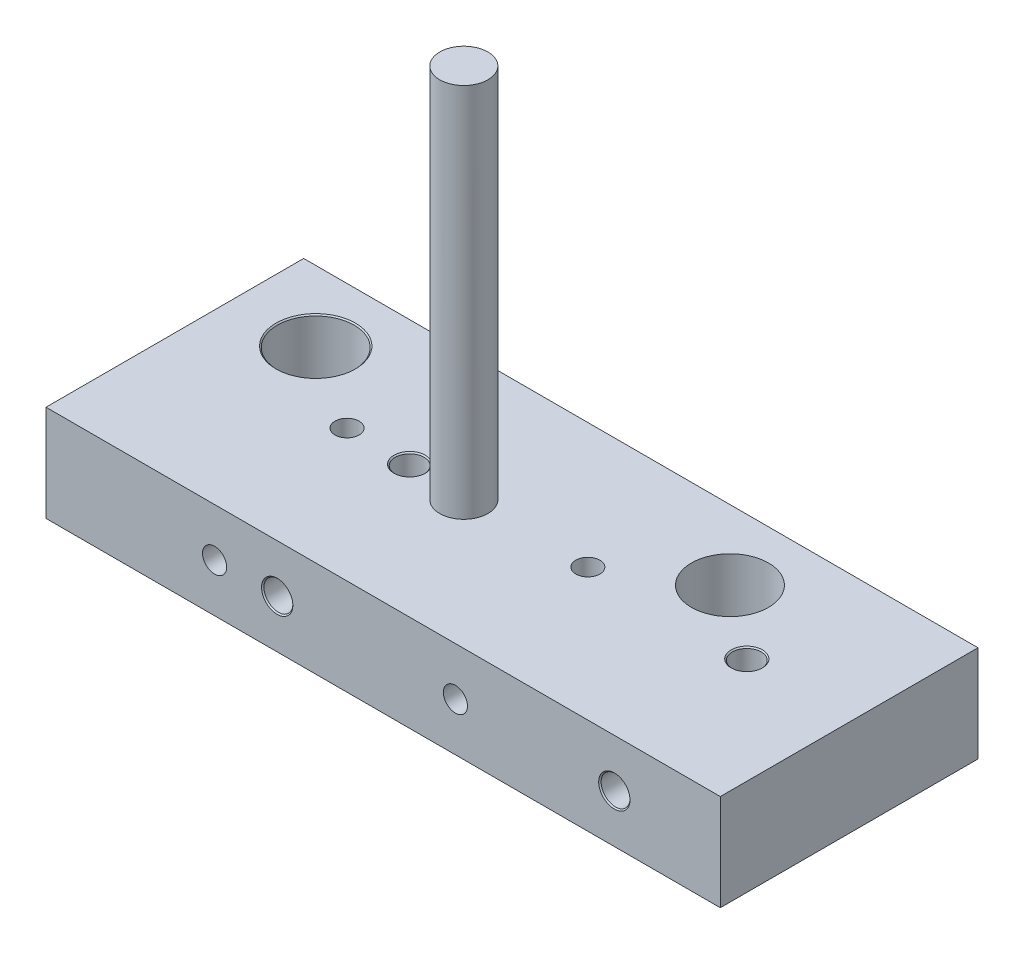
ISO-10303-21;
HEADER;
FILE_DESCRIPTION(('STEP AP214'),'2;1');
FILE_NAME('part.step','',(''),(''),'','','');
FILE_SCHEMA(('AUTOMOTIVE_DESIGN { 1 0 10303 214 1 1 1 1 }'));
ENDSEC;
DATA;
#1=APPLICATION_CONTEXT('core data for automotive mechanical design processes');
#2=APPLICATION_PROTOCOL_DEFINITION('international standard','automotive_design',2000,#1);
#3=PRODUCT_CONTEXT('',#1,'mechanical');
#4=PRODUCT('Part','Part','',(#3));
#5=PRODUCT_RELATED_PRODUCT_CATEGORY('part','',(#4));
#6=PRODUCT_DEFINITION_FORMATION('','',#4);
#7=PRODUCT_DEFINITION_CONTEXT('part definition',#1,'design');
#8=PRODUCT_DEFINITION('design','',#6,#7);
#9=PRODUCT_DEFINITION_SHAPE('','',#8);
#10=(LENGTH_UNIT() NAMED_UNIT(*) SI_UNIT(.MILLI.,.METRE.));
#11=(NAMED_UNIT(*) PLANE_ANGLE_UNIT() SI_UNIT($,.RADIAN.));
#12=(NAMED_UNIT(*) SI_UNIT($,.STERADIAN.) SOLID_ANGLE_UNIT());
#13=UNCERTAINTY_MEASURE_WITH_UNIT(LENGTH_MEASURE(1.E-05),#10,'distance_accuracy_value','');
#14=(GEOMETRIC_REPRESENTATION_CONTEXT(3) GLOBAL_UNCERTAINTY_ASSIGNED_CONTEXT((#13)) GLOBAL_UNIT_ASSIGNED_CONTEXT((#10,
#11,#12)) REPRESENTATION_CONTEXT('',''));
#15=CARTESIAN_POINT('',(0.,0.,0.));
#16=DIRECTION('',(0.,0.,1.));
#17=DIRECTION('',(1.,0.,0.));
#18=AXIS2_PLACEMENT_3D('',#15,#16,#17);
#19=CARTESIAN_POINT('',(0.,20.,-53.5));
#20=DIRECTION('',(0.,-1.,0.));
#21=DIRECTION('',(0.,0.,-1.));
#22=AXIS2_PLACEMENT_3D('',#19,#20,#21);
#23=PLANE('',#22);
#24=CARTESIAN_POINT('',(103.,20.,-39.));
#25=DIRECTION('',(0.,-1.,0.));
#26=DIRECTION('',(0.,0.,-1.));
#27=AXIS2_PLACEMENT_3D('',#24,#25,#26);
#28=CIRCLE('',#27,7.99999999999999);
#29=CARTESIAN_POINT('',(103.,20.,-47.));
#30=VERTEX_POINT('',#29);
#31=EDGE_CURVE('E9178',#30,#30,#28,.T.);
#32=ORIENTED_EDGE('',*,*,#31,.T.);
#33=EDGE_LOOP('',(#32));
#34=FACE_BOUND('',#33,.T.);
#35=DIRECTION('',(0.,0.,1.));
#36=VECTOR('',#35,1.);
#37=CARTESIAN_POINT('',(0.,20.,0.));
#38=LINE('',#37,#36);
#39=CARTESIAN_POINT('',(0.,20.,-53.5));
#40=VERTEX_POINT('',#39);
#41=CARTESIAN_POINT('',(0.,20.,0.));
#42=VERTEX_POINT('',#41);
#43=EDGE_CURVE('E9306',#40,#42,#38,.T.);
#44=ORIENTED_EDGE('',*,*,#43,.T.);
#45=DIRECTION('',(1.,0.,0.));
#46=VECTOR('',#45,1.);
#47=CARTESIAN_POINT('',(0.,20.,0.));
#48=LINE('',#47,#46);
#49=CARTESIAN_POINT('',(140.,20.,0.));
#50=VERTEX_POINT('',#49);
#51=EDGE_CURVE('E9304',#42,#50,#48,.T.);
#52=ORIENTED_EDGE('',*,*,#51,.T.);
#53=DIRECTION('',(0.,0.,-1.));
#54=VECTOR('',#53,1.);
#55=CARTESIAN_POINT('',(140.,20.,0.));
#56=LINE('',#55,#54);
#57=CARTESIAN_POINT('',(140.,20.,-53.5));
#58=VERTEX_POINT('',#57);
#59=EDGE_CURVE('E9302',#50,#58,#56,.T.);
#60=ORIENTED_EDGE('',*,*,#59,.T.);
#61=DIRECTION('',(-1.,0.,0.));
#62=VECTOR('',#61,1.);
#63=CARTESIAN_POINT('',(0.,20.,-53.5));
#64=LINE('',#63,#62);
#65=EDGE_CURVE('E9300',#58,#40,#64,.T.);
#66=ORIENTED_EDGE('',*,*,#65,.T.);
#67=EDGE_LOOP('',(#44,#52,#60,#66));
#68=FACE_BOUND('',#67,.T.);
#69=CARTESIAN_POINT('',(17.,20.,-39.));
#70=DIRECTION('',(0.,-1.,0.));
#71=DIRECTION('',(0.,0.,-1.));
#72=AXIS2_PLACEMENT_3D('',#69,#70,#71);
#73=CIRCLE('',#72,8.24999999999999);
#74=CARTESIAN_POINT('',(17.,20.,-47.25));
#75=VERTEX_POINT('',#74);
#76=EDGE_CURVE('E9327',#75,#75,#73,.T.);
#77=ORIENTED_EDGE('',*,*,#76,.T.);
#78=EDGE_LOOP('',(#77));
#79=FACE_BOUND('',#78,.T.);
#80=CARTESIAN_POINT('',(35.,20.,-27.5));
#81=DIRECTION('',(0.,-1.,0.));
#82=DIRECTION('',(0.,0.,-1.));
#83=AXIS2_PLACEMENT_3D('',#80,#81,#82);
#84=CIRCLE('',#83,2.5);
#85=CARTESIAN_POINT('',(35.,20.,-30.));
#86=VERTEX_POINT('',#85);
#87=EDGE_CURVE('E9333',#86,#86,#84,.T.);
#88=ORIENTED_EDGE('',*,*,#87,.T.);
#89=EDGE_LOOP('',(#88));
#90=FACE_BOUND('',#89,.T.);
#91=CARTESIAN_POINT('',(85.,20.,-27.5));
#92=DIRECTION('',(0.,-1.,0.));
#93=DIRECTION('',(0.,0.,-1.));
#94=AXIS2_PLACEMENT_3D('',#91,#92,#93);
#95=CIRCLE('',#94,2.49999999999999);
#96=CARTESIAN_POINT('',(85.,20.,-30.));
#97=VERTEX_POINT('',#96);
#98=EDGE_CURVE('E9339',#97,#97,#95,.T.);
#99=ORIENTED_EDGE('',*,*,#98,.T.);
#100=EDGE_LOOP('',(#99));
#101=FACE_BOUND('',#100,.T.);
#102=CARTESIAN_POINT('',(48.,20.,-27.5));
#103=DIRECTION('',(0.,-1.,0.));
#104=DIRECTION('',(0.,0.,-1.));
#105=AXIS2_PLACEMENT_3D('',#102,#103,#104);
#106=CIRCLE('',#105,3.25);
#107=CARTESIAN_POINT('',(48.,20.,-30.75));
#108=VERTEX_POINT('',#107);
#109=EDGE_CURVE('E9351',#108,#108,#106,.T.);
#110=ORIENTED_EDGE('',*,*,#109,.T.);
#111=EDGE_LOOP('',(#110));
#112=FACE_BOUND('',#111,.T.);
#113=CARTESIAN_POINT('',(118.,20.,-27.5));
#114=DIRECTION('',(0.,-1.,0.));
#115=DIRECTION('',(0.,0.,-1.));
#116=AXIS2_PLACEMENT_3D('',#113,#114,#115);
#117=CIRCLE('',#116,3.24999999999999);
#118=CARTESIAN_POINT('',(118.,20.,-30.75));
#119=VERTEX_POINT('',#118);
#120=EDGE_CURVE('E9363',#119,#119,#117,.T.);
#121=ORIENTED_EDGE('',*,*,#120,.T.);
#122=EDGE_LOOP('',(#121));
#123=FACE_BOUND('',#122,.T.);
#124=CARTESIAN_POINT('',(60.,20.,-26.75));
#125=DIRECTION('',(0.,-1.,0.));
#126=DIRECTION('',(0.,0.,-1.));
#127=AXIS2_PLACEMENT_3D('',#124,#125,#126);
#128=CIRCLE('',#127,5.);
#129=CARTESIAN_POINT('',(60.,20.,-31.75));
#130=VERTEX_POINT('',#129);
#131=EDGE_CURVE('E11',#130,#130,#128,.F.);
#132=ORIENTED_EDGE('',*,*,#131,.F.);
#133=EDGE_LOOP('',(#132));
#134=FACE_BOUND('',#133,.T.);
#135=ADVANCED_FACE('F9174',(#34,#68,#79,#90,#101,#112,#123,#134),#23,.F.);
#136=CARTESIAN_POINT('',(85.,0.,-27.5));
#137=DIRECTION('',(0.,-1.,0.));
#138=DIRECTION('',(0.,0.,-1.));
#139=AXIS2_PLACEMENT_3D('',#136,#137,#138);
#140=CYLINDRICAL_SURFACE('',#139,2.49999999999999);
#141=CARTESIAN_POINT('',(85.,0.,-27.5));
#142=DIRECTION('',(0.,-1.,0.));
#143=DIRECTION('',(0.,0.,-1.));
#144=AXIS2_PLACEMENT_3D('',#141,#142,#143);
#145=CIRCLE('',#144,2.49999999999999);
#146=CARTESIAN_POINT('',(85.,0.,-30.));
#147=VERTEX_POINT('',#146);
#148=EDGE_CURVE('E9336',#147,#147,#145,.T.);
#149=ORIENTED_EDGE('',*,*,#148,.T.);
#150=EDGE_LOOP('',(#149));
#151=FACE_BOUND('',#150,.T.);
#152=CARTESIAN_POINT('',(85.,10.,-27.5));
#153=DIRECTION('',(0.,-0.707106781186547,-0.707106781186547));
#154=DIRECTION('',(0.,-0.707106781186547,0.707106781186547));
#155=AXIS2_PLACEMENT_3D('',#152,#153,#154);
#156=ELLIPSE('',#155,3.53553390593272,2.49999999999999);
#157=CARTESIAN_POINT('',(82.5,10.,-27.5));
#158=VERTEX_POINT('',#157);
#159=CARTESIAN_POINT('',(87.5,10.,-27.5));
#160=VERTEX_POINT('',#159);
#161=EDGE_CURVE('E9189',#158,#160,#156,.F.);
#162=ORIENTED_EDGE('',*,*,#161,.T.);
#163=CARTESIAN_POINT('',(85.,10.,-27.5));
#164=DIRECTION('',(0.,-0.707106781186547,0.707106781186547));
#165=DIRECTION('',(0.,-0.707106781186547,-0.707106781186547));
#166=AXIS2_PLACEMENT_3D('',#163,#164,#165);
#167=ELLIPSE('',#166,3.53553390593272,2.49999999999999);
#168=EDGE_CURVE('E9183',#160,#158,#167,.F.);
#169=ORIENTED_EDGE('',*,*,#168,.T.);
#170=EDGE_LOOP('',(#162,#169));
#171=FACE_BOUND('',#170,.T.);
#172=ADVANCED_FACE('F9252',(#151,#171),#140,.F.);
#173=CARTESIAN_POINT('',(35.,0.,-27.5));
#174=DIRECTION('',(0.,-1.,0.));
#175=DIRECTION('',(0.,0.,-1.));
#176=AXIS2_PLACEMENT_3D('',#173,#174,#175);
#177=CYLINDRICAL_SURFACE('',#176,2.49999999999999);
#178=CARTESIAN_POINT('',(35.,0.,-27.5));
#179=DIRECTION('',(0.,-1.,0.));
#180=DIRECTION('',(0.,0.,-1.));
#181=AXIS2_PLACEMENT_3D('',#178,#179,#180);
#182=CIRCLE('',#181,2.49999999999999);
#183=CARTESIAN_POINT('',(35.,0.,-30.));
#184=VERTEX_POINT('',#183);
#185=EDGE_CURVE('E9330',#184,#184,#182,.T.);
#186=ORIENTED_EDGE('',*,*,#185,.T.);
#187=EDGE_LOOP('',(#186));
#188=FACE_BOUND('',#187,.T.);
#189=CARTESIAN_POINT('',(35.,10.,-27.5));
#190=DIRECTION('',(0.,-0.707106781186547,-0.707106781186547));
#191=DIRECTION('',(0.,-0.707106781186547,0.707106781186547));
#192=AXIS2_PLACEMENT_3D('',#189,#190,#191);
#193=ELLIPSE('',#192,3.53553390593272,2.49999999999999);
#194=CARTESIAN_POINT('',(32.5,10.,-27.5));
#195=VERTEX_POINT('',#194);
#196=CARTESIAN_POINT('',(37.5,10.,-27.5));
#197=VERTEX_POINT('',#196);
#198=EDGE_CURVE('E9196',#195,#197,#193,.F.);
#199=ORIENTED_EDGE('',*,*,#198,.T.);
#200=CARTESIAN_POINT('',(35.,10.,-27.5));
#201=DIRECTION('',(0.,-0.707106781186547,0.707106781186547));
#202=DIRECTION('',(0.,-0.707106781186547,-0.707106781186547));
#203=AXIS2_PLACEMENT_3D('',#200,#201,#202);
#204=ELLIPSE('',#203,3.53553390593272,2.49999999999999);
#205=EDGE_CURVE('E9250',#197,#195,#204,.F.);
#206=ORIENTED_EDGE('',*,*,#205,.T.);
#207=EDGE_LOOP('',(#199,#206));
#208=FACE_BOUND('',#207,.T.);
#209=ADVANCED_FACE('F9549',(#188,#208),#177,.F.);
#210=CARTESIAN_POINT('',(118.,0.,-27.5));
#211=DIRECTION('',(0.,-1.,0.));
#212=DIRECTION('',(0.,0.,-1.));
#213=AXIS2_PLACEMENT_3D('',#210,#211,#212);
#214=CYLINDRICAL_SURFACE('',#213,3.);
#215=CARTESIAN_POINT('',(118.,0.250000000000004,-27.5));
#216=DIRECTION('',(0.,-1.,0.));
#217=DIRECTION('',(0.,0.,-1.));
#218=AXIS2_PLACEMENT_3D('',#215,#216,#217);
#219=CIRCLE('',#218,3.);
#220=CARTESIAN_POINT('',(118.,0.250000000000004,-30.5));
#221=VERTEX_POINT('',#220);
#222=EDGE_CURVE('E9357',#221,#221,#219,.T.);
#223=ORIENTED_EDGE('',*,*,#222,.T.);
#224=EDGE_LOOP('',(#223));
#225=FACE_BOUND('',#224,.T.);
#226=CARTESIAN_POINT('',(118.,10.,-27.5));
#227=DIRECTION('',(0.,-0.707106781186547,-0.707106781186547));
#228=DIRECTION('',(0.,-0.707106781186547,0.707106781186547));
#229=AXIS2_PLACEMENT_3D('',#226,#227,#228);
#230=ELLIPSE('',#229,4.24264068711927,2.99999999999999);
#231=CARTESIAN_POINT('',(115.,10.,-27.5));
#232=VERTEX_POINT('',#231);
#233=CARTESIAN_POINT('',(121.,10.,-27.5));
#234=VERTEX_POINT('',#233);
#235=EDGE_CURVE('E9275',#232,#234,#230,.F.);
#236=ORIENTED_EDGE('',*,*,#235,.T.);
#237=CARTESIAN_POINT('',(118.,10.,-27.5));
#238=DIRECTION('',(0.,-0.707106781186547,0.707106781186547));
#239=DIRECTION('',(0.,-0.707106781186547,-0.707106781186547));
#240=AXIS2_PLACEMENT_3D('',#237,#238,#239);
#241=ELLIPSE('',#240,4.24264068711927,2.99999999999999);
#242=EDGE_CURVE('E9266',#234,#232,#241,.F.);
#243=ORIENTED_EDGE('',*,*,#242,.T.);
#244=EDGE_LOOP('',(#236,#243));
#245=FACE_BOUND('',#244,.T.);
#246=ADVANCED_FACE('F9525',(#225,#245),#214,.F.);
#247=CARTESIAN_POINT('',(48.,0.,-27.5));
#248=DIRECTION('',(0.,-1.,0.));
#249=DIRECTION('',(0.,0.,-1.));
#250=AXIS2_PLACEMENT_3D('',#247,#248,#249);
#251=CYLINDRICAL_SURFACE('',#250,3.);
#252=CARTESIAN_POINT('',(48.,0.250000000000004,-27.5));
#253=DIRECTION('',(0.,-1.,0.));
#254=DIRECTION('',(0.,0.,-1.));
#255=AXIS2_PLACEMENT_3D('',#252,#253,#254);
#256=CIRCLE('',#255,3.);
#257=CARTESIAN_POINT('',(48.,0.250000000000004,-30.5));
#258=VERTEX_POINT('',#257);
#259=EDGE_CURVE('E9345',#258,#258,#256,.T.);
#260=ORIENTED_EDGE('',*,*,#259,.T.);
#261=EDGE_LOOP('',(#260));
#262=FACE_BOUND('',#261,.T.);
#263=CARTESIAN_POINT('',(48.,10.,-27.5));
#264=DIRECTION('',(0.,-0.707106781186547,-0.707106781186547));
#265=DIRECTION('',(0.,-0.707106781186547,0.707106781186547));
#266=AXIS2_PLACEMENT_3D('',#263,#264,#265);
#267=ELLIPSE('',#266,4.24264068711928,2.99999999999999);
#268=CARTESIAN_POINT('',(45.,10.,-27.5));
#269=VERTEX_POINT('',#268);
#270=CARTESIAN_POINT('',(51.,10.,-27.5));
#271=VERTEX_POINT('',#270);
#272=EDGE_CURVE('E9286',#269,#271,#267,.F.);
#273=ORIENTED_EDGE('',*,*,#272,.T.);
#274=CARTESIAN_POINT('',(48.,10.,-27.5));
#275=DIRECTION('',(0.,-0.707106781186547,0.707106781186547));
#276=DIRECTION('',(0.,-0.707106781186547,-0.707106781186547));
#277=AXIS2_PLACEMENT_3D('',#274,#275,#276);
#278=ELLIPSE('',#277,4.24264068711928,2.99999999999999);
#279=EDGE_CURVE('E9277',#271,#269,#278,.F.);
#280=ORIENTED_EDGE('',*,*,#279,.T.);
#281=EDGE_LOOP('',(#273,#280));
#282=FACE_BOUND('',#281,.T.);
#283=ADVANCED_FACE('F9538',(#262,#282),#251,.F.);
#284=CARTESIAN_POINT('',(0.,20.,0.));
#285=DIRECTION('',(1.,0.,0.));
#286=DIRECTION('',(0.,0.,-1.));
#287=AXIS2_PLACEMENT_3D('',#284,#285,#286);
#288=PLANE('',#287);
#289=DIRECTION('',(0.,0.,1.));
#290=VECTOR('',#289,1.);
#291=CARTESIAN_POINT('',(0.,0.,0.));
#292=LINE('',#291,#290);
#293=CARTESIAN_POINT('',(0.,0.,-53.5));
#294=VERTEX_POINT('',#293);
#295=CARTESIAN_POINT('',(0.,0.,0.));
#296=VERTEX_POINT('',#295);
#297=EDGE_CURVE('E9315',#294,#296,#292,.T.);
#298=ORIENTED_EDGE('',*,*,#297,.T.);
#299=DIRECTION('',(0.,-1.,0.));
#300=VECTOR('',#299,1.);
#301=CARTESIAN_POINT('',(0.,20.,0.));
#302=LINE('',#301,#300);
#303=EDGE_CURVE('E9288',#42,#296,#302,.T.);
#304=ORIENTED_EDGE('',*,*,#303,.F.);
#305=ORIENTED_EDGE('',*,*,#43,.F.);
#306=DIRECTION('',(0.,-1.,0.));
#307=VECTOR('',#306,1.);
#308=CARTESIAN_POINT('',(0.,20.,-53.5));
#309=LINE('',#308,#307);
#310=EDGE_CURVE('E9297',#40,#294,#309,.T.);
#311=ORIENTED_EDGE('',*,*,#310,.T.);
#312=EDGE_LOOP('',(#298,#304,#305,#311));
#313=FACE_BOUND('',#312,.T.);
#314=ADVANCED_FACE('F9176',(#313),#288,.F.);
#315=CARTESIAN_POINT('',(0.,20.,0.));
#316=DIRECTION('',(0.,0.,-1.));
#317=DIRECTION('',(-1.,0.,0.));
#318=AXIS2_PLACEMENT_3D('',#315,#316,#317);
#319=PLANE('',#318);
#320=CARTESIAN_POINT('',(85.,10.,0.));
#321=DIRECTION('',(0.,0.,1.));
#322=DIRECTION('',(1.,0.,0.));
#323=AXIS2_PLACEMENT_3D('',#320,#321,#322);
#324=CIRCLE('',#323,2.49999999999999);
#325=CARTESIAN_POINT('',(87.5,10.,0.));
#326=VERTEX_POINT('',#325);
#327=EDGE_CURVE('E9396',#326,#326,#324,.T.);
#328=ORIENTED_EDGE('',*,*,#327,.F.);
#329=EDGE_LOOP('',(#328));
#330=FACE_BOUND('',#329,.T.);
#331=CARTESIAN_POINT('',(35.,10.,0.));
#332=DIRECTION('',(0.,0.,1.));
#333=DIRECTION('',(1.,0.,0.));
#334=AXIS2_PLACEMENT_3D('',#331,#332,#333);
#335=CIRCLE('',#334,2.49999999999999);
#336=CARTESIAN_POINT('',(37.5,10.,0.));
#337=VERTEX_POINT('',#336);
#338=EDGE_CURVE('E9390',#337,#337,#335,.T.);
#339=ORIENTED_EDGE('',*,*,#338,.F.);
#340=EDGE_LOOP('',(#339));
#341=FACE_BOUND('',#340,.T.);
#342=CARTESIAN_POINT('',(118.,10.,0.));
#343=DIRECTION('',(0.,0.,1.));
#344=DIRECTION('',(1.,0.,0.));
#345=AXIS2_PLACEMENT_3D('',#342,#343,#344);
#346=CIRCLE('',#345,3.25);
#347=CARTESIAN_POINT('',(121.25,10.,0.));
#348=VERTEX_POINT('',#347);
#349=EDGE_CURVE('E9378',#348,#348,#346,.T.);
#350=ORIENTED_EDGE('',*,*,#349,.F.);
#351=EDGE_LOOP('',(#350));
#352=FACE_BOUND('',#351,.T.);
#353=CARTESIAN_POINT('',(48.,10.,0.));
#354=DIRECTION('',(0.,0.,1.));
#355=DIRECTION('',(1.,0.,0.));
#356=AXIS2_PLACEMENT_3D('',#353,#354,#355);
#357=CIRCLE('',#356,3.25);
#358=CARTESIAN_POINT('',(51.25,10.,0.));
#359=VERTEX_POINT('',#358);
#360=EDGE_CURVE('E9366',#359,#359,#357,.T.);
#361=ORIENTED_EDGE('',*,*,#360,.F.);
#362=EDGE_LOOP('',(#361));
#363=FACE_BOUND('',#362,.T.);
#364=DIRECTION('',(1.,0.,0.));
#365=VECTOR('',#364,1.);
#366=CARTESIAN_POINT('',(0.,0.,0.));
#367=LINE('',#366,#365);
#368=CARTESIAN_POINT('',(140.,0.,0.));
#369=VERTEX_POINT('',#368);
#370=EDGE_CURVE('E9313',#296,#369,#367,.T.);
#371=ORIENTED_EDGE('',*,*,#370,.T.);
#372=DIRECTION('',(0.,-1.,0.));
#373=VECTOR('',#372,1.);
#374=CARTESIAN_POINT('',(140.,20.,0.));
#375=LINE('',#374,#373);
#376=EDGE_CURVE('E9291',#50,#369,#375,.T.);
#377=ORIENTED_EDGE('',*,*,#376,.F.);
#378=ORIENTED_EDGE('',*,*,#51,.F.);
#379=ORIENTED_EDGE('',*,*,#303,.T.);
#380=EDGE_LOOP('',(#371,#377,#378,#379));
#381=FACE_BOUND('',#380,.T.);
#382=ADVANCED_FACE('F9452',(#330,#341,#352,#363,#381),#319,.F.);
#383=CARTESIAN_POINT('',(140.,20.,0.));
#384=DIRECTION('',(-1.,0.,0.));
#385=DIRECTION('',(0.,0.,1.));
#386=AXIS2_PLACEMENT_3D('',#383,#384,#385);
#387=PLANE('',#386);
#388=DIRECTION('',(0.,0.,-1.));
#389=VECTOR('',#388,1.);
#390=CARTESIAN_POINT('',(140.,0.,0.));
#391=LINE('',#390,#389);
#392=CARTESIAN_POINT('',(140.,0.,-53.5));
#393=VERTEX_POINT('',#392);
#394=EDGE_CURVE('E9311',#369,#393,#391,.T.);
#395=ORIENTED_EDGE('',*,*,#394,.T.);
#396=DIRECTION('',(0.,-1.,0.));
#397=VECTOR('',#396,1.);
#398=CARTESIAN_POINT('',(140.,20.,-53.5));
#399=LINE('',#398,#397);
#400=EDGE_CURVE('E9294',#58,#393,#399,.T.);
#401=ORIENTED_EDGE('',*,*,#400,.F.);
#402=ORIENTED_EDGE('',*,*,#59,.F.);
#403=ORIENTED_EDGE('',*,*,#376,.T.);
#404=EDGE_LOOP('',(#395,#401,#402,#403));
#405=FACE_BOUND('',#404,.T.);
#406=ADVANCED_FACE('F9449',(#405),#387,.F.);
#407=CARTESIAN_POINT('',(0.,20.,-53.5));
#408=DIRECTION('',(0.,0.,1.));
#409=DIRECTION('',(1.,0.,0.));
#410=AXIS2_PLACEMENT_3D('',#407,#408,#409);
#411=PLANE('',#410);
#412=CARTESIAN_POINT('',(85.,10.,-53.5));
#413=DIRECTION('',(0.,0.,1.));
#414=DIRECTION('',(1.,0.,0.));
#415=AXIS2_PLACEMENT_3D('',#412,#413,#414);
#416=CIRCLE('',#415,2.49999999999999);
#417=CARTESIAN_POINT('',(87.5,10.,-53.5));
#418=VERTEX_POINT('',#417);
#419=EDGE_CURVE('E9399',#418,#418,#416,.T.);
#420=ORIENTED_EDGE('',*,*,#419,.T.);
#421=EDGE_LOOP('',(#420));
#422=FACE_BOUND('',#421,.T.);
#423=CARTESIAN_POINT('',(35.,10.,-53.5));
#424=DIRECTION('',(0.,0.,1.));
#425=DIRECTION('',(1.,0.,0.));
#426=AXIS2_PLACEMENT_3D('',#423,#424,#425);
#427=CIRCLE('',#426,2.49999999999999);
#428=CARTESIAN_POINT('',(37.5,10.,-53.5));
#429=VERTEX_POINT('',#428);
#430=EDGE_CURVE('E9393',#429,#429,#427,.T.);
#431=ORIENTED_EDGE('',*,*,#430,.T.);
#432=EDGE_LOOP('',(#431));
#433=FACE_BOUND('',#432,.T.);
#434=CARTESIAN_POINT('',(118.,10.,-53.5));
#435=DIRECTION('',(0.,0.,1.));
#436=DIRECTION('',(1.,0.,0.));
#437=AXIS2_PLACEMENT_3D('',#434,#435,#436);
#438=CIRCLE('',#437,3.24999999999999);
#439=CARTESIAN_POINT('',(121.25,10.,-53.5));
#440=VERTEX_POINT('',#439);
#441=EDGE_CURVE('E9387',#440,#440,#438,.T.);
#442=ORIENTED_EDGE('',*,*,#441,.T.);
#443=EDGE_LOOP('',(#442));
#444=FACE_BOUND('',#443,.T.);
#445=CARTESIAN_POINT('',(48.,10.,-53.5));
#446=DIRECTION('',(0.,0.,1.));
#447=DIRECTION('',(1.,0.,0.));
#448=AXIS2_PLACEMENT_3D('',#445,#446,#447);
#449=CIRCLE('',#448,3.24999999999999);
#450=CARTESIAN_POINT('',(51.25,10.,-53.5));
#451=VERTEX_POINT('',#450);
#452=EDGE_CURVE('E9375',#451,#451,#449,.T.);
#453=ORIENTED_EDGE('',*,*,#452,.T.);
#454=EDGE_LOOP('',(#453));
#455=FACE_BOUND('',#454,.T.);
#456=DIRECTION('',(-1.,0.,0.));
#457=VECTOR('',#456,1.);
#458=CARTESIAN_POINT('',(0.,0.,-53.5));
#459=LINE('',#458,#457);
#460=EDGE_CURVE('E9309',#393,#294,#459,.T.);
#461=ORIENTED_EDGE('',*,*,#460,.T.);
#462=ORIENTED_EDGE('',*,*,#310,.F.);
#463=ORIENTED_EDGE('',*,*,#65,.F.);
#464=ORIENTED_EDGE('',*,*,#400,.T.);
#465=EDGE_LOOP('',(#461,#462,#463,#464));
#466=FACE_BOUND('',#465,.T.);
#467=ADVANCED_FACE('F9425',(#422,#433,#444,#455,#466),#411,.F.);
#468=CARTESIAN_POINT('',(0.,0.,-53.5));
#469=DIRECTION('',(0.,-1.,0.));
#470=DIRECTION('',(0.,0.,-1.));
#471=AXIS2_PLACEMENT_3D('',#468,#469,#470);
#472=PLANE('',#471);
#473=CARTESIAN_POINT('',(103.,0.,-39.));
#474=DIRECTION('',(0.,-1.,0.));
#475=DIRECTION('',(0.,0.,-1.));
#476=AXIS2_PLACEMENT_3D('',#473,#474,#475);
#477=CIRCLE('',#476,8.25000000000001);
#478=CARTESIAN_POINT('',(103.,0.,-47.25));
#479=VERTEX_POINT('',#478);
#480=EDGE_CURVE('E9405',#479,#479,#477,.T.);
#481=ORIENTED_EDGE('',*,*,#480,.F.);
#482=EDGE_LOOP('',(#481));
#483=FACE_BOUND('',#482,.T.);
#484=CARTESIAN_POINT('',(118.,0.,-27.5));
#485=DIRECTION('',(0.,-1.,0.));
#486=DIRECTION('',(0.,0.,-1.));
#487=AXIS2_PLACEMENT_3D('',#484,#485,#486);
#488=CIRCLE('',#487,3.25);
#489=CARTESIAN_POINT('',(118.,0.,-30.75));
#490=VERTEX_POINT('',#489);
#491=EDGE_CURVE('E9354',#490,#490,#488,.T.);
#492=ORIENTED_EDGE('',*,*,#491,.F.);
#493=EDGE_LOOP('',(#492));
#494=FACE_BOUND('',#493,.T.);
#495=CARTESIAN_POINT('',(48.,0.,-27.5));
#496=DIRECTION('',(0.,-1.,0.));
#497=DIRECTION('',(0.,0.,-1.));
#498=AXIS2_PLACEMENT_3D('',#495,#496,#497);
#499=CIRCLE('',#498,3.25);
#500=CARTESIAN_POINT('',(48.,0.,-30.75));
#501=VERTEX_POINT('',#500);
#502=EDGE_CURVE('E9342',#501,#501,#499,.T.);
#503=ORIENTED_EDGE('',*,*,#502,.F.);
#504=EDGE_LOOP('',(#503));
#505=FACE_BOUND('',#504,.T.);
#506=ORIENTED_EDGE('',*,*,#148,.F.);
#507=EDGE_LOOP('',(#506));
#508=FACE_BOUND('',#507,.T.);
#509=ORIENTED_EDGE('',*,*,#185,.F.);
#510=EDGE_LOOP('',(#509));
#511=FACE_BOUND('',#510,.T.);
#512=CARTESIAN_POINT('',(17.,0.,-39.));
#513=DIRECTION('',(0.,-1.,0.));
#514=DIRECTION('',(0.,0.,-1.));
#515=AXIS2_PLACEMENT_3D('',#512,#513,#514);
#516=CIRCLE('',#515,8.25);
#517=CARTESIAN_POINT('',(17.,0.,-47.25));
#518=VERTEX_POINT('',#517);
#519=EDGE_CURVE('E9318',#518,#518,#516,.T.);
#520=ORIENTED_EDGE('',*,*,#519,.F.);
#521=EDGE_LOOP('',(#520));
#522=FACE_BOUND('',#521,.T.);
#523=ORIENTED_EDGE('',*,*,#297,.F.);
#524=ORIENTED_EDGE('',*,*,#460,.F.);
#525=ORIENTED_EDGE('',*,*,#394,.F.);
#526=ORIENTED_EDGE('',*,*,#370,.F.);
#527=EDGE_LOOP('',(#523,#524,#525,#526));
#528=FACE_BOUND('',#527,.T.);
#529=ADVANCED_FACE('F9421',(#483,#494,#505,#508,#511,#522,#528),#472,.T.);
#530=CARTESIAN_POINT('',(17.,0.,-39.));
#531=DIRECTION('',(0.,-1.,0.));
#532=DIRECTION('',(0.,0.,-1.));
#533=AXIS2_PLACEMENT_3D('',#530,#531,#532);
#534=CONICAL_SURFACE('',#533,8.25,0.785398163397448);
#535=CARTESIAN_POINT('',(17.,0.250000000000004,-39.));
#536=DIRECTION('',(0.,-1.,0.));
#537=DIRECTION('',(0.,0.,-1.));
#538=AXIS2_PLACEMENT_3D('',#535,#536,#537);
#539=CIRCLE('',#538,8.);
#540=CARTESIAN_POINT('',(17.,0.250000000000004,-47.));
#541=VERTEX_POINT('',#540);
#542=EDGE_CURVE('E9321',#541,#541,#539,.T.);
#543=ORIENTED_EDGE('',*,*,#542,.F.);
#544=EDGE_LOOP('',(#543));
#545=FACE_BOUND('',#544,.T.);
#546=ORIENTED_EDGE('',*,*,#519,.T.);
#547=EDGE_LOOP('',(#546));
#548=FACE_BOUND('',#547,.T.);
#549=ADVANCED_FACE('F9424',(#545,#548),#534,.F.);
#550=CARTESIAN_POINT('',(17.,0.,-39.));
#551=DIRECTION('',(0.,-1.,0.));
#552=DIRECTION('',(0.,0.,-1.));
#553=AXIS2_PLACEMENT_3D('',#550,#551,#552);
#554=CYLINDRICAL_SURFACE('',#553,7.99999999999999);
#555=CARTESIAN_POINT('',(17.,19.75,-39.));
#556=DIRECTION('',(0.,-1.,0.));
#557=DIRECTION('',(0.,0.,-1.));
#558=AXIS2_PLACEMENT_3D('',#555,#556,#557);
#559=CIRCLE('',#558,7.99999999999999);
#560=CARTESIAN_POINT('',(17.,19.75,-47.));
#561=VERTEX_POINT('',#560);
#562=EDGE_CURVE('E9324',#561,#561,#559,.T.);
#563=ORIENTED_EDGE('',*,*,#562,.F.);
#564=EDGE_LOOP('',(#563));
#565=FACE_BOUND('',#564,.T.);
#566=ORIENTED_EDGE('',*,*,#542,.T.);
#567=EDGE_LOOP('',(#566));
#568=FACE_BOUND('',#567,.T.);
#569=ADVANCED_FACE('F9552',(#565,#568),#554,.F.);
#570=CARTESIAN_POINT('',(17.,19.75,-39.));
#571=DIRECTION('',(0.,1.,0.));
#572=DIRECTION('',(0.,0.,1.));
#573=AXIS2_PLACEMENT_3D('',#570,#571,#572);
#574=CONICAL_SURFACE('',#573,7.99999999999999,0.785398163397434);
#575=ORIENTED_EDGE('',*,*,#76,.F.);
#576=EDGE_LOOP('',(#575));
#577=FACE_BOUND('',#576,.T.);
#578=ORIENTED_EDGE('',*,*,#562,.T.);
#579=EDGE_LOOP('',(#578));
#580=FACE_BOUND('',#579,.T.);
#581=ADVANCED_FACE('F9547',(#577,#580),#574,.F.);
#582=CARTESIAN_POINT('',(35.,10.,-27.5));
#583=DIRECTION('',(0.,-0.707106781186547,-0.707106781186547));
#584=DIRECTION('',(0.,-0.707106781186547,0.707106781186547));
#585=AXIS2_PLACEMENT_3D('',#582,#583,#584);
#586=ELLIPSE('',#585,3.53553390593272,2.49999999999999);
#587=EDGE_CURVE('E9262',#195,#197,#586,.T.);
#588=ORIENTED_EDGE('',*,*,#587,.T.);
#589=CARTESIAN_POINT('',(35.,10.,-27.5));
#590=DIRECTION('',(0.,-0.707106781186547,0.707106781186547));
#591=DIRECTION('',(0.,-0.707106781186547,-0.707106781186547));
#592=AXIS2_PLACEMENT_3D('',#589,#590,#591);
#593=ELLIPSE('',#592,3.53553390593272,2.49999999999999);
#594=EDGE_CURVE('E9259',#197,#195,#593,.T.);
#595=ORIENTED_EDGE('',*,*,#594,.T.);
#596=EDGE_LOOP('',(#588,#595));
#597=FACE_BOUND('',#596,.T.);
#598=ORIENTED_EDGE('',*,*,#87,.F.);
#599=EDGE_LOOP('',(#598));
#600=FACE_BOUND('',#599,.T.);
#601=ADVANCED_FACE('F9544',(#597,#600),#177,.F.);
#602=CARTESIAN_POINT('',(85.,10.,-27.5));
#603=DIRECTION('',(0.,-0.707106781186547,-0.707106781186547));
#604=DIRECTION('',(0.,-0.707106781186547,0.707106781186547));
#605=AXIS2_PLACEMENT_3D('',#602,#603,#604);
#606=ELLIPSE('',#605,3.53553390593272,2.49999999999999);
#607=EDGE_CURVE('E9242',#158,#160,#606,.T.);
#608=ORIENTED_EDGE('',*,*,#607,.T.);
#609=CARTESIAN_POINT('',(85.,10.,-27.5));
#610=DIRECTION('',(0.,-0.707106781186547,0.707106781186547));
#611=DIRECTION('',(0.,-0.707106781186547,-0.707106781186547));
#612=AXIS2_PLACEMENT_3D('',#609,#610,#611);
#613=ELLIPSE('',#612,3.53553390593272,2.49999999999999);
#614=EDGE_CURVE('E9246',#160,#158,#613,.T.);
#615=ORIENTED_EDGE('',*,*,#614,.T.);
#616=EDGE_LOOP('',(#608,#615));
#617=FACE_BOUND('',#616,.T.);
#618=ORIENTED_EDGE('',*,*,#98,.F.);
#619=EDGE_LOOP('',(#618));
#620=FACE_BOUND('',#619,.T.);
#621=ADVANCED_FACE('F9254',(#617,#620),#140,.F.);
#622=CARTESIAN_POINT('',(48.,0.,-27.5));
#623=DIRECTION('',(0.,-1.,0.));
#624=DIRECTION('',(0.,0.,-1.));
#625=AXIS2_PLACEMENT_3D('',#622,#623,#624);
#626=CONICAL_SURFACE('',#625,3.25,0.785398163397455);
#627=ORIENTED_EDGE('',*,*,#259,.F.);
#628=EDGE_LOOP('',(#627));
#629=FACE_BOUND('',#628,.T.);
#630=ORIENTED_EDGE('',*,*,#502,.T.);
#631=EDGE_LOOP('',(#630));
#632=FACE_BOUND('',#631,.T.);
#633=ADVANCED_FACE('F9536',(#629,#632),#626,.F.);
#634=CARTESIAN_POINT('',(48.,10.,-27.5));
#635=DIRECTION('',(0.,-0.707106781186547,-0.707106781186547));
#636=DIRECTION('',(0.,-0.707106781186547,0.707106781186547));
#637=AXIS2_PLACEMENT_3D('',#634,#635,#636);
#638=ELLIPSE('',#637,4.24264068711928,2.99999999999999);
#639=EDGE_CURVE('E9283',#269,#271,#638,.T.);
#640=ORIENTED_EDGE('',*,*,#639,.T.);
#641=CARTESIAN_POINT('',(48.,10.,-27.5));
#642=DIRECTION('',(0.,-0.707106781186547,0.707106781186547));
#643=DIRECTION('',(0.,-0.707106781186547,-0.707106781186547));
#644=AXIS2_PLACEMENT_3D('',#641,#642,#643);
#645=ELLIPSE('',#644,4.24264068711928,2.99999999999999);
#646=EDGE_CURVE('E9280',#271,#269,#645,.T.);
#647=ORIENTED_EDGE('',*,*,#646,.T.);
#648=EDGE_LOOP('',(#640,#647));
#649=FACE_BOUND('',#648,.T.);
#650=CARTESIAN_POINT('',(48.,19.75,-27.5));
#651=DIRECTION('',(0.,-1.,0.));
#652=DIRECTION('',(0.,0.,-1.));
#653=AXIS2_PLACEMENT_3D('',#650,#651,#652);
#654=CIRCLE('',#653,3.);
#655=CARTESIAN_POINT('',(48.,19.75,-30.5));
#656=VERTEX_POINT('',#655);
#657=EDGE_CURVE('E9348',#656,#656,#654,.T.);
#658=ORIENTED_EDGE('',*,*,#657,.F.);
#659=EDGE_LOOP('',(#658));
#660=FACE_BOUND('',#659,.T.);
#661=ADVANCED_FACE('F9532',(#649,#660),#251,.F.);
#662=CARTESIAN_POINT('',(48.,19.75,-27.5));
#663=DIRECTION('',(0.,1.,0.));
#664=DIRECTION('',(0.,0.,1.));
#665=AXIS2_PLACEMENT_3D('',#662,#663,#664);
#666=CONICAL_SURFACE('',#665,3.,0.785398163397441);
#667=ORIENTED_EDGE('',*,*,#109,.F.);
#668=EDGE_LOOP('',(#667));
#669=FACE_BOUND('',#668,.T.);
#670=ORIENTED_EDGE('',*,*,#657,.T.);
#671=EDGE_LOOP('',(#670));
#672=FACE_BOUND('',#671,.T.);
#673=ADVANCED_FACE('F9528',(#669,#672),#666,.F.);
#674=CARTESIAN_POINT('',(118.,0.,-27.5));
#675=DIRECTION('',(0.,-1.,0.));
#676=DIRECTION('',(0.,0.,-1.));
#677=AXIS2_PLACEMENT_3D('',#674,#675,#676);
#678=CONICAL_SURFACE('',#677,3.25,0.785398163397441);
#679=ORIENTED_EDGE('',*,*,#222,.F.);
#680=EDGE_LOOP('',(#679));
#681=FACE_BOUND('',#680,.T.);
#682=ORIENTED_EDGE('',*,*,#491,.T.);
#683=EDGE_LOOP('',(#682));
#684=FACE_BOUND('',#683,.T.);
#685=ADVANCED_FACE('F9523',(#681,#684),#678,.F.);
#686=CARTESIAN_POINT('',(118.,10.,-27.5));
#687=DIRECTION('',(0.,-0.707106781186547,-0.707106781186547));
#688=DIRECTION('',(0.,-0.707106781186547,0.707106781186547));
#689=AXIS2_PLACEMENT_3D('',#686,#687,#688);
#690=ELLIPSE('',#689,4.24264068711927,2.99999999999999);
#691=EDGE_CURVE('E9272',#232,#234,#690,.T.);
#692=ORIENTED_EDGE('',*,*,#691,.T.);
#693=CARTESIAN_POINT('',(118.,10.,-27.5));
#694=DIRECTION('',(0.,-0.707106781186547,0.707106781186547));
#695=DIRECTION('',(0.,-0.707106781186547,-0.707106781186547));
#696=AXIS2_PLACEMENT_3D('',#693,#694,#695);
#697=ELLIPSE('',#696,4.24264068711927,2.99999999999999);
#698=EDGE_CURVE('E9269',#234,#232,#697,.T.);
#699=ORIENTED_EDGE('',*,*,#698,.T.);
#700=EDGE_LOOP('',(#692,#699));
#701=FACE_BOUND('',#700,.T.);
#702=CARTESIAN_POINT('',(118.,19.75,-27.5));
#703=DIRECTION('',(0.,-1.,0.));
#704=DIRECTION('',(0.,0.,-1.));
#705=AXIS2_PLACEMENT_3D('',#702,#703,#704);
#706=CIRCLE('',#705,2.99999999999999);
#707=CARTESIAN_POINT('',(118.,19.75,-30.5));
#708=VERTEX_POINT('',#707);
#709=EDGE_CURVE('E9360',#708,#708,#706,.T.);
#710=ORIENTED_EDGE('',*,*,#709,.F.);
#711=EDGE_LOOP('',(#710));
#712=FACE_BOUND('',#711,.T.);
#713=ADVANCED_FACE('F9519',(#701,#712),#214,.F.);
#714=CARTESIAN_POINT('',(118.,19.75,-27.5));
#715=DIRECTION('',(0.,1.,0.));
#716=DIRECTION('',(0.,0.,1.));
#717=AXIS2_PLACEMENT_3D('',#714,#715,#716);
#718=CONICAL_SURFACE('',#717,2.99999999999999,0.785398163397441);
#719=ORIENTED_EDGE('',*,*,#120,.F.);
#720=EDGE_LOOP('',(#719));
#721=FACE_BOUND('',#720,.T.);
#722=ORIENTED_EDGE('',*,*,#709,.T.);
#723=EDGE_LOOP('',(#722));
#724=FACE_BOUND('',#723,.T.);
#725=ADVANCED_FACE('F9516',(#721,#724),#718,.F.);
#726=CARTESIAN_POINT('',(48.,10.,0.));
#727=DIRECTION('',(0.,0.,1.));
#728=DIRECTION('',(1.,0.,0.));
#729=AXIS2_PLACEMENT_3D('',#726,#727,#728);
#730=CYLINDRICAL_SURFACE('',#729,2.99999999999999);
#731=CARTESIAN_POINT('',(48.,10.,-0.250000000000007));
#732=DIRECTION('',(0.,0.,1.));
#733=DIRECTION('',(1.,0.,0.));
#734=AXIS2_PLACEMENT_3D('',#731,#732,#733);
#735=CIRCLE('',#734,3.);
#736=CARTESIAN_POINT('',(51.,10.,-0.250000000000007));
#737=VERTEX_POINT('',#736);
#738=EDGE_CURVE('E9369',#737,#737,#735,.T.);
#739=ORIENTED_EDGE('',*,*,#738,.T.);
#740=EDGE_LOOP('',(#739));
#741=FACE_BOUND('',#740,.T.);
#742=ORIENTED_EDGE('',*,*,#272,.F.);
#743=ORIENTED_EDGE('',*,*,#646,.F.);
#744=EDGE_LOOP('',(#742,#743));
#745=FACE_BOUND('',#744,.T.);
#746=ADVANCED_FACE('F9512',(#741,#745),#730,.F.);
#747=CARTESIAN_POINT('',(48.,10.,0.));
#748=DIRECTION('',(0.,0.,1.));
#749=DIRECTION('',(1.,0.,0.));
#750=AXIS2_PLACEMENT_3D('',#747,#748,#749);
#751=CONICAL_SURFACE('',#750,3.25,0.785398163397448);
#752=ORIENTED_EDGE('',*,*,#738,.F.);
#753=EDGE_LOOP('',(#752));
#754=FACE_BOUND('',#753,.T.);
#755=ORIENTED_EDGE('',*,*,#360,.T.);
#756=EDGE_LOOP('',(#755));
#757=FACE_BOUND('',#756,.T.);
#758=ADVANCED_FACE('F9510',(#754,#757),#751,.F.);
#759=CARTESIAN_POINT('',(48.,10.,-53.25));
#760=DIRECTION('',(0.,0.,1.));
#761=DIRECTION('',(1.,0.,0.));
#762=AXIS2_PLACEMENT_3D('',#759,#760,#761);
#763=CIRCLE('',#762,2.99999999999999);
#764=CARTESIAN_POINT('',(51.,10.,-53.25));
#765=VERTEX_POINT('',#764);
#766=EDGE_CURVE('E9372',#765,#765,#763,.T.);
#767=ORIENTED_EDGE('',*,*,#766,.F.);
#768=EDGE_LOOP('',(#767));
#769=FACE_BOUND('',#768,.T.);
#770=ORIENTED_EDGE('',*,*,#639,.F.);
#771=ORIENTED_EDGE('',*,*,#279,.F.);
#772=EDGE_LOOP('',(#770,#771));
#773=FACE_BOUND('',#772,.T.);
#774=ADVANCED_FACE('F9506',(#769,#773),#730,.F.);
#775=CARTESIAN_POINT('',(48.,10.,-53.25));
#776=DIRECTION('',(0.,0.,-1.));
#777=DIRECTION('',(-1.,0.,0.));
#778=AXIS2_PLACEMENT_3D('',#775,#776,#777);
#779=CONICAL_SURFACE('',#778,2.99999999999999,0.785398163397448);
#780=ORIENTED_EDGE('',*,*,#452,.F.);
#781=EDGE_LOOP('',(#780));
#782=FACE_BOUND('',#781,.T.);
#783=ORIENTED_EDGE('',*,*,#766,.T.);
#784=EDGE_LOOP('',(#783));
#785=FACE_BOUND('',#784,.T.);
#786=ADVANCED_FACE('F9503',(#782,#785),#779,.F.);
#787=CARTESIAN_POINT('',(118.,10.,0.));
#788=DIRECTION('',(0.,0.,1.));
#789=DIRECTION('',(1.,0.,0.));
#790=AXIS2_PLACEMENT_3D('',#787,#788,#789);
#791=CYLINDRICAL_SURFACE('',#790,2.99999999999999);
#792=CARTESIAN_POINT('',(118.,10.,-0.250000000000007));
#793=DIRECTION('',(0.,0.,1.));
#794=DIRECTION('',(1.,0.,0.));
#795=AXIS2_PLACEMENT_3D('',#792,#793,#794);
#796=CIRCLE('',#795,2.99999999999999);
#797=CARTESIAN_POINT('',(121.,10.,-0.250000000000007));
#798=VERTEX_POINT('',#797);
#799=EDGE_CURVE('E9381',#798,#798,#796,.T.);
#800=ORIENTED_EDGE('',*,*,#799,.T.);
#801=EDGE_LOOP('',(#800));
#802=FACE_BOUND('',#801,.T.);
#803=ORIENTED_EDGE('',*,*,#235,.F.);
#804=ORIENTED_EDGE('',*,*,#698,.F.);
#805=EDGE_LOOP('',(#803,#804));
#806=FACE_BOUND('',#805,.T.);
#807=ADVANCED_FACE('F9499',(#802,#806),#791,.F.);
#808=CARTESIAN_POINT('',(118.,10.,0.));
#809=DIRECTION('',(0.,0.,1.));
#810=DIRECTION('',(1.,0.,0.));
#811=AXIS2_PLACEMENT_3D('',#808,#809,#810);
#812=CONICAL_SURFACE('',#811,3.25,0.785398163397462);
#813=ORIENTED_EDGE('',*,*,#799,.F.);
#814=EDGE_LOOP('',(#813));
#815=FACE_BOUND('',#814,.T.);
#816=ORIENTED_EDGE('',*,*,#349,.T.);
#817=EDGE_LOOP('',(#816));
#818=FACE_BOUND('',#817,.T.);
#819=ADVANCED_FACE('F9497',(#815,#818),#812,.F.);
#820=CARTESIAN_POINT('',(118.,10.,-53.25));
#821=DIRECTION('',(0.,0.,1.));
#822=DIRECTION('',(1.,0.,0.));
#823=AXIS2_PLACEMENT_3D('',#820,#821,#822);
#824=CIRCLE('',#823,2.99999999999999);
#825=CARTESIAN_POINT('',(121.,10.,-53.25));
#826=VERTEX_POINT('',#825);
#827=EDGE_CURVE('E9384',#826,#826,#824,.T.);
#828=ORIENTED_EDGE('',*,*,#827,.F.);
#829=EDGE_LOOP('',(#828));
#830=FACE_BOUND('',#829,.T.);
#831=ORIENTED_EDGE('',*,*,#691,.F.);
#832=ORIENTED_EDGE('',*,*,#242,.F.);
#833=EDGE_LOOP('',(#831,#832));
#834=FACE_BOUND('',#833,.T.);
#835=ADVANCED_FACE('F9493',(#830,#834),#791,.F.);
#836=CARTESIAN_POINT('',(118.,10.,-53.25));
#837=DIRECTION('',(0.,0.,-1.));
#838=DIRECTION('',(-1.,0.,0.));
#839=AXIS2_PLACEMENT_3D('',#836,#837,#838);
#840=CONICAL_SURFACE('',#839,2.99999999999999,0.785398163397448);
#841=ORIENTED_EDGE('',*,*,#441,.F.);
#842=EDGE_LOOP('',(#841));
#843=FACE_BOUND('',#842,.T.);
#844=ORIENTED_EDGE('',*,*,#827,.T.);
#845=EDGE_LOOP('',(#844));
#846=FACE_BOUND('',#845,.T.);
#847=ADVANCED_FACE('F9490',(#843,#846),#840,.F.);
#848=CARTESIAN_POINT('',(35.,10.,0.));
#849=DIRECTION('',(0.,0.,1.));
#850=DIRECTION('',(1.,0.,0.));
#851=AXIS2_PLACEMENT_3D('',#848,#849,#850);
#852=CYLINDRICAL_SURFACE('',#851,2.49999999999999);
#853=ORIENTED_EDGE('',*,*,#338,.T.);
#854=EDGE_LOOP('',(#853));
#855=FACE_BOUND('',#854,.T.);
#856=ORIENTED_EDGE('',*,*,#198,.F.);
#857=ORIENTED_EDGE('',*,*,#594,.F.);
#858=EDGE_LOOP('',(#856,#857));
#859=FACE_BOUND('',#858,.T.);
#860=ADVANCED_FACE('F9488',(#855,#859),#852,.F.);
#861=ORIENTED_EDGE('',*,*,#430,.F.);
#862=EDGE_LOOP('',(#861));
#863=FACE_BOUND('',#862,.T.);
#864=ORIENTED_EDGE('',*,*,#587,.F.);
#865=ORIENTED_EDGE('',*,*,#205,.F.);
#866=EDGE_LOOP('',(#864,#865));
#867=FACE_BOUND('',#866,.T.);
#868=ADVANCED_FACE('F9485',(#863,#867),#852,.F.);
#869=CARTESIAN_POINT('',(85.,10.,0.));
#870=DIRECTION('',(0.,0.,1.));
#871=DIRECTION('',(1.,0.,0.));
#872=AXIS2_PLACEMENT_3D('',#869,#870,#871);
#873=CYLINDRICAL_SURFACE('',#872,2.49999999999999);
#874=ORIENTED_EDGE('',*,*,#327,.T.);
#875=EDGE_LOOP('',(#874));
#876=FACE_BOUND('',#875,.T.);
#877=ORIENTED_EDGE('',*,*,#161,.F.);
#878=ORIENTED_EDGE('',*,*,#614,.F.);
#879=EDGE_LOOP('',(#877,#878));
#880=FACE_BOUND('',#879,.T.);
#881=ADVANCED_FACE('F9249',(#876,#880),#873,.F.);
#882=ORIENTED_EDGE('',*,*,#419,.F.);
#883=EDGE_LOOP('',(#882));
#884=FACE_BOUND('',#883,.T.);
#885=ORIENTED_EDGE('',*,*,#607,.F.);
#886=ORIENTED_EDGE('',*,*,#168,.F.);
#887=EDGE_LOOP('',(#885,#886));
#888=FACE_BOUND('',#887,.T.);
#889=ADVANCED_FACE('F9243',(#884,#888),#873,.F.);
#890=CARTESIAN_POINT('',(60.,98.,-26.75));
#891=DIRECTION('',(0.,-1.,0.));
#892=DIRECTION('',(0.,0.,-1.));
#893=AXIS2_PLACEMENT_3D('',#890,#891,#892);
#894=CYLINDRICAL_SURFACE('',#893,5.);
#895=CARTESIAN_POINT('',(60.,98.,-26.75));
#896=DIRECTION('',(0.,1.,0.));
#897=DIRECTION('',(0.,0.,1.));
#898=AXIS2_PLACEMENT_3D('',#895,#896,#897);
#899=CIRCLE('',#898,5.);
#900=CARTESIAN_POINT('',(60.,98.,-21.75));
#901=VERTEX_POINT('',#900);
#902=EDGE_CURVE('E9402',#901,#901,#899,.T.);
#903=ORIENTED_EDGE('',*,*,#902,.F.);
#904=EDGE_LOOP('',(#903));
#905=FACE_BOUND('',#904,.T.);
#906=ORIENTED_EDGE('',*,*,#131,.T.);
#907=EDGE_LOOP('',(#906));
#908=FACE_BOUND('',#907,.T.);
#909=ADVANCED_FACE('F9470',(#905,#908),#894,.T.);
#910=CARTESIAN_POINT('',(60.,98.,-26.75));
#911=DIRECTION('',(0.,1.,0.));
#912=DIRECTION('',(0.,0.,1.));
#913=AXIS2_PLACEMENT_3D('',#910,#911,#912);
#914=PLANE('',#913);
#915=ORIENTED_EDGE('',*,*,#902,.T.);
#916=EDGE_LOOP('',(#915));
#917=FACE_BOUND('',#916,.T.);
#918=ADVANCED_FACE('F9472',(#917),#914,.T.);
#919=CARTESIAN_POINT('',(103.,0.,-39.));
#920=DIRECTION('',(0.,-1.,0.));
#921=DIRECTION('',(0.,0.,-1.));
#922=AXIS2_PLACEMENT_3D('',#919,#920,#921);
#923=CYLINDRICAL_SURFACE('',#922,7.99999999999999);
#924=CARTESIAN_POINT('',(103.,0.250000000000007,-39.));
#925=DIRECTION('',(0.,-1.,0.));
#926=DIRECTION('',(0.,0.,-1.));
#927=AXIS2_PLACEMENT_3D('',#924,#925,#926);
#928=CIRCLE('',#927,7.99999999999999);
#929=CARTESIAN_POINT('',(103.,0.250000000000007,-47.));
#930=VERTEX_POINT('',#929);
#931=EDGE_CURVE('E9408',#930,#930,#928,.T.);
#932=ORIENTED_EDGE('',*,*,#931,.T.);
#933=EDGE_LOOP('',(#932));
#934=FACE_BOUND('',#933,.T.);
#935=ORIENTED_EDGE('',*,*,#31,.F.);
#936=EDGE_LOOP('',(#935));
#937=FACE_BOUND('',#936,.T.);
#938=ADVANCED_FACE('F9412',(#934,#937),#923,.F.);
#939=CARTESIAN_POINT('',(103.,0.,-39.));
#940=DIRECTION('',(0.,-1.,0.));
#941=DIRECTION('',(0.,0.,-1.));
#942=AXIS2_PLACEMENT_3D('',#939,#940,#941);
#943=CONICAL_SURFACE('',#942,8.25000000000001,0.785398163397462);
#944=ORIENTED_EDGE('',*,*,#931,.F.);
#945=EDGE_LOOP('',(#944));
#946=FACE_BOUND('',#945,.T.);
#947=ORIENTED_EDGE('',*,*,#480,.T.);
#948=EDGE_LOOP('',(#947));
#949=FACE_BOUND('',#948,.T.);
#950=ADVANCED_FACE('F9415',(#946,#949),#943,.F.);
#951=CLOSED_SHELL('',(#135,#172,#209,#246,#283,#314,#382,#406,#467,#529,#549,#569,#581,#601,
#621,#633,#661,#673,#685,#713,#725,#746,#758,#774,#786,#807,#819,#835,#847,#860,#868,#881,#889,
#909,#918,#938,#950));
#952=MANIFOLD_SOLID_BREP('B2',#951);
#953=ADVANCED_BREP_SHAPE_REPRESENTATION('',(#18,#952),#14);
#954=SHAPE_DEFINITION_REPRESENTATION(#9,#953);
ENDSEC;
END-ISO-10303-21;
